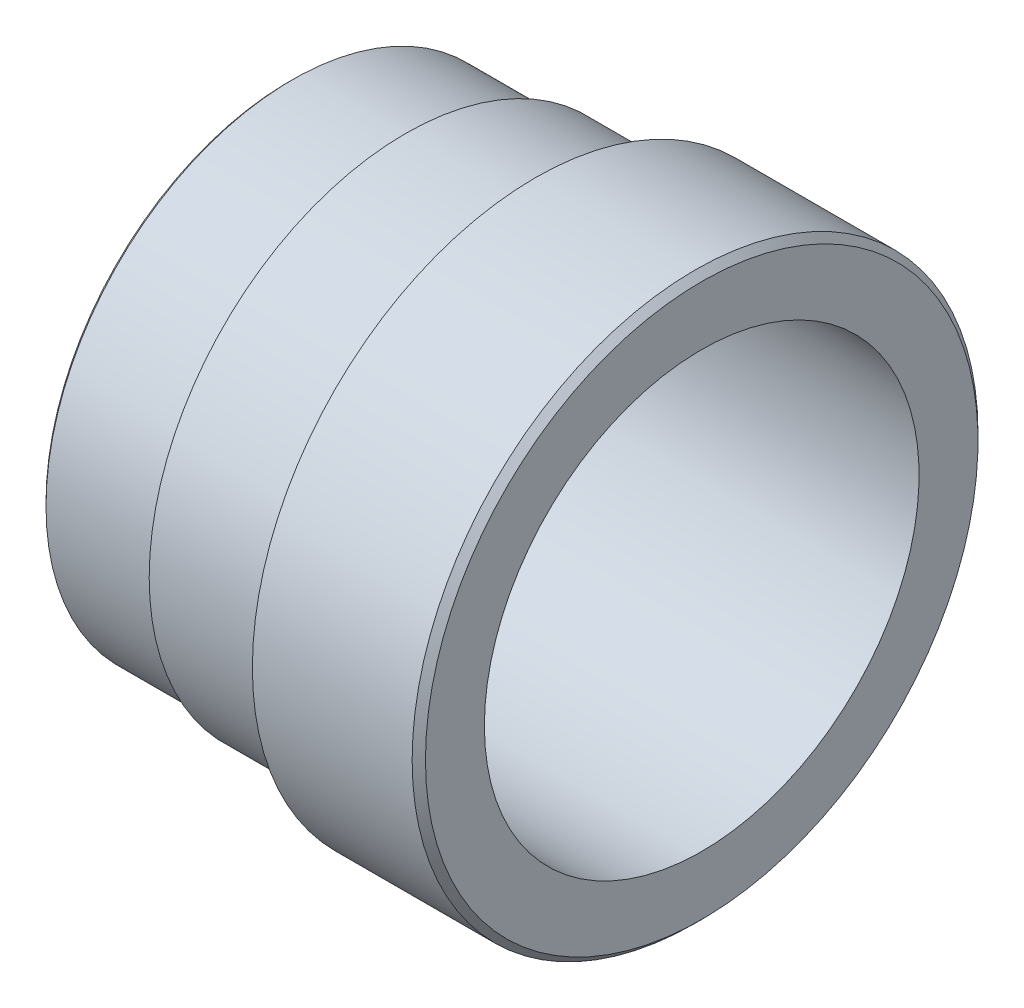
ISO-10303-21;
HEADER;
FILE_DESCRIPTION(('STEP AP214'),'2;1');
FILE_NAME('part.step','',(''),(''),'','','');
FILE_SCHEMA(('AUTOMOTIVE_DESIGN { 1 0 10303 214 1 1 1 1 }'));
ENDSEC;
DATA;
#1=APPLICATION_CONTEXT('core data for automotive mechanical design processes');
#2=APPLICATION_PROTOCOL_DEFINITION('international standard','automotive_design',2000,#1);
#3=PRODUCT_CONTEXT('',#1,'mechanical');
#4=PRODUCT('Part','Part','',(#3));
#5=PRODUCT_RELATED_PRODUCT_CATEGORY('part','',(#4));
#6=PRODUCT_DEFINITION_FORMATION('','',#4);
#7=PRODUCT_DEFINITION_CONTEXT('part definition',#1,'design');
#8=PRODUCT_DEFINITION('design','',#6,#7);
#9=PRODUCT_DEFINITION_SHAPE('','',#8);
#10=(LENGTH_UNIT() NAMED_UNIT(*) SI_UNIT(.MILLI.,.METRE.));
#11=(NAMED_UNIT(*) PLANE_ANGLE_UNIT() SI_UNIT($,.RADIAN.));
#12=(NAMED_UNIT(*) SI_UNIT($,.STERADIAN.) SOLID_ANGLE_UNIT());
#13=UNCERTAINTY_MEASURE_WITH_UNIT(LENGTH_MEASURE(1.E-05),#10,'distance_accuracy_value','');
#14=(GEOMETRIC_REPRESENTATION_CONTEXT(3) GLOBAL_UNCERTAINTY_ASSIGNED_CONTEXT((#13)) GLOBAL_UNIT_ASSIGNED_CONTEXT((#10,
#11,#12)) REPRESENTATION_CONTEXT('',''));
#15=CARTESIAN_POINT('',(0.,0.,0.));
#16=DIRECTION('',(0.,0.,1.));
#17=DIRECTION('',(1.,0.,0.));
#18=AXIS2_PLACEMENT_3D('',#15,#16,#17);
#19=CARTESIAN_POINT('',(0.,0.,0.));
#20=DIRECTION('',(-1.,0.,0.));
#21=DIRECTION('',(0.,0.,0.999999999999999));
#22=AXIS2_PLACEMENT_3D('',#19,#20,#21);
#23=CONICAL_SURFACE('',#22,83.,0.785398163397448);
#24=CARTESIAN_POINT('',(-2.,0.,0.));
#25=DIRECTION('',(-1.,0.,0.));
#26=DIRECTION('',(0.,0.,0.999999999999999));
#27=AXIS2_PLACEMENT_3D('',#24,#25,#26);
#28=CIRCLE('',#27,85.);
#29=CARTESIAN_POINT('',(-2.,0.,84.9999999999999));
#30=VERTEX_POINT('',#29);
#31=EDGE_CURVE('E79',#30,#30,#28,.T.);
#32=ORIENTED_EDGE('',*,*,#31,.F.);
#33=EDGE_LOOP('',(#32));
#34=FACE_BOUND('',#33,.T.);
#35=CARTESIAN_POINT('',(0.,0.,0.));
#36=DIRECTION('',(-1.,0.,0.));
#37=DIRECTION('',(0.,0.,0.999999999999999));
#38=AXIS2_PLACEMENT_3D('',#35,#36,#37);
#39=CIRCLE('',#38,83.);
#40=CARTESIAN_POINT('',(0.,0.,82.9999999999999));
#41=VERTEX_POINT('',#40);
#42=EDGE_CURVE('E12',#41,#41,#39,.T.);
#43=ORIENTED_EDGE('',*,*,#42,.T.);
#44=EDGE_LOOP('',(#43));
#45=FACE_BOUND('',#44,.T.);
#46=ADVANCED_FACE('F42',(#34,#45),#23,.T.);
#47=CARTESIAN_POINT('',(0.,65.3,0.));
#48=DIRECTION('',(-1.,0.,0.));
#49=DIRECTION('',(0.,0.,0.999999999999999));
#50=AXIS2_PLACEMENT_3D('',#47,#48,#49);
#51=PLANE('',#50);
#52=ORIENTED_EDGE('',*,*,#42,.F.);
#53=EDGE_LOOP('',(#52));
#54=FACE_BOUND('',#53,.T.);
#55=CARTESIAN_POINT('',(0.,0.,0.));
#56=DIRECTION('',(-1.,0.,0.));
#57=DIRECTION('',(0.,0.,0.999999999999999));
#58=AXIS2_PLACEMENT_3D('',#55,#56,#57);
#59=CIRCLE('',#58,65.3);
#60=CARTESIAN_POINT('',(0.,0.,65.2999999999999));
#61=VERTEX_POINT('',#60);
#62=EDGE_CURVE('E48',#61,#61,#59,.T.);
#63=ORIENTED_EDGE('',*,*,#62,.T.);
#64=EDGE_LOOP('',(#63));
#65=FACE_BOUND('',#64,.T.);
#66=ADVANCED_FACE('F86',(#54,#65),#51,.F.);
#67=CARTESIAN_POINT('',(-124.,0.,0.));
#68=DIRECTION('',(-1.,0.,0.));
#69=DIRECTION('',(0.,0.,0.999999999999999));
#70=AXIS2_PLACEMENT_3D('',#67,#68,#69);
#71=CYLINDRICAL_SURFACE('',#70,65.3);
#72=ORIENTED_EDGE('',*,*,#62,.F.);
#73=EDGE_LOOP('',(#72));
#74=FACE_BOUND('',#73,.T.);
#75=CARTESIAN_POINT('',(-124.,0.,0.));
#76=DIRECTION('',(-1.,0.,0.));
#77=DIRECTION('',(0.,0.,0.999999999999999));
#78=AXIS2_PLACEMENT_3D('',#75,#76,#77);
#79=CIRCLE('',#78,65.3);
#80=CARTESIAN_POINT('',(-124.,0.,65.2999999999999));
#81=VERTEX_POINT('',#80);
#82=EDGE_CURVE('E52',#81,#81,#79,.T.);
#83=ORIENTED_EDGE('',*,*,#82,.T.);
#84=EDGE_LOOP('',(#83));
#85=FACE_BOUND('',#84,.T.);
#86=ADVANCED_FACE('F90',(#74,#85),#71,.F.);
#87=CARTESIAN_POINT('',(-124.,72.9999999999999,0.));
#88=DIRECTION('',(1.,0.,0.));
#89=DIRECTION('',(0.,0.,-0.999999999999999));
#90=AXIS2_PLACEMENT_3D('',#87,#88,#89);
#91=PLANE('',#90);
#92=ORIENTED_EDGE('',*,*,#82,.F.);
#93=EDGE_LOOP('',(#92));
#94=FACE_BOUND('',#93,.T.);
#95=CARTESIAN_POINT('',(-124.,0.,0.));
#96=DIRECTION('',(-1.,0.,0.));
#97=DIRECTION('',(0.,0.,0.999999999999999));
#98=AXIS2_PLACEMENT_3D('',#95,#96,#97);
#99=CIRCLE('',#98,73.);
#100=CARTESIAN_POINT('',(-124.,0.,72.9999999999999));
#101=VERTEX_POINT('',#100);
#102=EDGE_CURVE('E56',#101,#101,#99,.T.);
#103=ORIENTED_EDGE('',*,*,#102,.T.);
#104=EDGE_LOOP('',(#103));
#105=FACE_BOUND('',#104,.T.);
#106=ADVANCED_FACE('F95',(#94,#105),#91,.F.);
#107=CARTESIAN_POINT('',(-123.,0.,0.));
#108=DIRECTION('',(1.,0.,0.));
#109=DIRECTION('',(0.,0.,-0.999999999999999));
#110=AXIS2_PLACEMENT_3D('',#107,#108,#109);
#111=CONICAL_SURFACE('',#110,74.,0.785398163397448);
#112=ORIENTED_EDGE('',*,*,#102,.F.);
#113=EDGE_LOOP('',(#112));
#114=FACE_BOUND('',#113,.T.);
#115=CARTESIAN_POINT('',(-123.,0.,0.));
#116=DIRECTION('',(-1.,0.,0.));
#117=DIRECTION('',(0.,0.,0.999999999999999));
#118=AXIS2_PLACEMENT_3D('',#115,#116,#117);
#119=CIRCLE('',#118,74.);
#120=CARTESIAN_POINT('',(-123.,0.,73.9999999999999));
#121=VERTEX_POINT('',#120);
#122=EDGE_CURVE('E61',#121,#121,#119,.T.);
#123=ORIENTED_EDGE('',*,*,#122,.T.);
#124=EDGE_LOOP('',(#123));
#125=FACE_BOUND('',#124,.T.);
#126=ADVANCED_FACE('F101',(#114,#125),#111,.T.);
#127=CARTESIAN_POINT('',(-124.,0.,0.));
#128=DIRECTION('',(-1.,0.,0.));
#129=DIRECTION('',(0.,0.,0.999999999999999));
#130=AXIS2_PLACEMENT_3D('',#127,#128,#129);
#131=CYLINDRICAL_SURFACE('',#130,74.);
#132=ORIENTED_EDGE('',*,*,#122,.F.);
#133=EDGE_LOOP('',(#132));
#134=FACE_BOUND('',#133,.T.);
#135=CARTESIAN_POINT('',(-89.,0.,0.));
#136=DIRECTION('',(-1.,0.,0.));
#137=DIRECTION('',(0.,0.,0.999999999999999));
#138=AXIS2_PLACEMENT_3D('',#135,#136,#137);
#139=CIRCLE('',#138,74.);
#140=CARTESIAN_POINT('',(-89.,0.,73.9999999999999));
#141=VERTEX_POINT('',#140);
#142=EDGE_CURVE('E64',#141,#141,#139,.T.);
#143=ORIENTED_EDGE('',*,*,#142,.T.);
#144=EDGE_LOOP('',(#143));
#145=FACE_BOUND('',#144,.T.);
#146=ADVANCED_FACE('F105',(#134,#145),#131,.T.);
#147=CARTESIAN_POINT('',(-89.,76.9999999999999,0.));
#148=DIRECTION('',(1.,0.,0.));
#149=DIRECTION('',(0.,0.,-0.999999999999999));
#150=AXIS2_PLACEMENT_3D('',#147,#148,#149);
#151=PLANE('',#150);
#152=ORIENTED_EDGE('',*,*,#142,.F.);
#153=EDGE_LOOP('',(#152));
#154=FACE_BOUND('',#153,.T.);
#155=CARTESIAN_POINT('',(-89.,0.,0.));
#156=DIRECTION('',(-1.,0.,0.));
#157=DIRECTION('',(0.,0.,0.999999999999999));
#158=AXIS2_PLACEMENT_3D('',#155,#156,#157);
#159=CIRCLE('',#158,77.);
#160=CARTESIAN_POINT('',(-89.,0.,76.9999999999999));
#161=VERTEX_POINT('',#160);
#162=EDGE_CURVE('E67',#161,#161,#159,.T.);
#163=ORIENTED_EDGE('',*,*,#162,.T.);
#164=EDGE_LOOP('',(#163));
#165=FACE_BOUND('',#164,.T.);
#166=ADVANCED_FACE('F109',(#154,#165),#151,.F.);
#167=CARTESIAN_POINT('',(-124.,0.,0.));
#168=DIRECTION('',(-1.,0.,0.));
#169=DIRECTION('',(0.,0.,0.999999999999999));
#170=AXIS2_PLACEMENT_3D('',#167,#168,#169);
#171=CYLINDRICAL_SURFACE('',#170,77.);
#172=ORIENTED_EDGE('',*,*,#162,.F.);
#173=EDGE_LOOP('',(#172));
#174=FACE_BOUND('',#173,.T.);
#175=CARTESIAN_POINT('',(-52.,0.,0.));
#176=DIRECTION('',(-1.,0.,0.));
#177=DIRECTION('',(0.,0.,0.999999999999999));
#178=AXIS2_PLACEMENT_3D('',#175,#176,#177);
#179=CIRCLE('',#178,77.);
#180=CARTESIAN_POINT('',(-52.,0.,76.9999999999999));
#181=VERTEX_POINT('',#180);
#182=EDGE_CURVE('E70',#181,#181,#179,.T.);
#183=ORIENTED_EDGE('',*,*,#182,.T.);
#184=EDGE_LOOP('',(#183));
#185=FACE_BOUND('',#184,.T.);
#186=ADVANCED_FACE('F113',(#174,#185),#171,.T.);
#187=CARTESIAN_POINT('',(-52.,0.,0.));
#188=DIRECTION('',(-1.,0.,0.));
#189=DIRECTION('',(0.,0.,0.999999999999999));
#190=AXIS2_PLACEMENT_3D('',#187,#188,#189);
#191=TOROIDAL_SURFACE('',#190,79.,1.99999999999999);
#192=ORIENTED_EDGE('',*,*,#182,.F.);
#193=EDGE_LOOP('',(#192));
#194=FACE_BOUND('',#193,.T.);
#195=CARTESIAN_POINT('',(-50.,0.,0.));
#196=DIRECTION('',(-1.,0.,0.));
#197=DIRECTION('',(0.,0.,0.999999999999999));
#198=AXIS2_PLACEMENT_3D('',#195,#196,#197);
#199=CIRCLE('',#198,79.);
#200=CARTESIAN_POINT('',(-50.,0.,78.9999999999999));
#201=VERTEX_POINT('',#200);
#202=EDGE_CURVE('E73',#201,#201,#199,.T.);
#203=ORIENTED_EDGE('',*,*,#202,.T.);
#204=EDGE_LOOP('',(#203));
#205=FACE_BOUND('',#204,.T.);
#206=ADVANCED_FACE('F117',(#194,#205),#191,.F.);
#207=CARTESIAN_POINT('',(-50.,84.9999999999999,0.));
#208=DIRECTION('',(1.,0.,0.));
#209=DIRECTION('',(0.,0.,-0.999999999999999));
#210=AXIS2_PLACEMENT_3D('',#207,#208,#209);
#211=PLANE('',#210);
#212=ORIENTED_EDGE('',*,*,#202,.F.);
#213=EDGE_LOOP('',(#212));
#214=FACE_BOUND('',#213,.T.);
#215=CARTESIAN_POINT('',(-50.,0.,0.));
#216=DIRECTION('',(-1.,0.,0.));
#217=DIRECTION('',(0.,0.,0.999999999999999));
#218=AXIS2_PLACEMENT_3D('',#215,#216,#217);
#219=CIRCLE('',#218,85.);
#220=CARTESIAN_POINT('',(-50.,0.,84.9999999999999));
#221=VERTEX_POINT('',#220);
#222=EDGE_CURVE('E76',#221,#221,#219,.T.);
#223=ORIENTED_EDGE('',*,*,#222,.T.);
#224=EDGE_LOOP('',(#223));
#225=FACE_BOUND('',#224,.T.);
#226=ADVANCED_FACE('F121',(#214,#225),#211,.F.);
#227=CARTESIAN_POINT('',(-124.,0.,0.));
#228=DIRECTION('',(-1.,0.,0.));
#229=DIRECTION('',(0.,0.,0.999999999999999));
#230=AXIS2_PLACEMENT_3D('',#227,#228,#229);
#231=CYLINDRICAL_SURFACE('',#230,85.);
#232=ORIENTED_EDGE('',*,*,#222,.F.);
#233=EDGE_LOOP('',(#232));
#234=FACE_BOUND('',#233,.T.);
#235=ORIENTED_EDGE('',*,*,#31,.T.);
#236=EDGE_LOOP('',(#235));
#237=FACE_BOUND('',#236,.T.);
#238=ADVANCED_FACE('F83',(#234,#237),#231,.T.);
#239=CLOSED_SHELL('',(#46,#66,#86,#106,#126,#146,#166,#186,#206,#226,#238));
#240=MANIFOLD_SOLID_BREP('B2',#239);
#241=ADVANCED_BREP_SHAPE_REPRESENTATION('',(#18,#240),#14);
#242=SHAPE_DEFINITION_REPRESENTATION(#9,#241);
ENDSEC;
END-ISO-10303-21;
